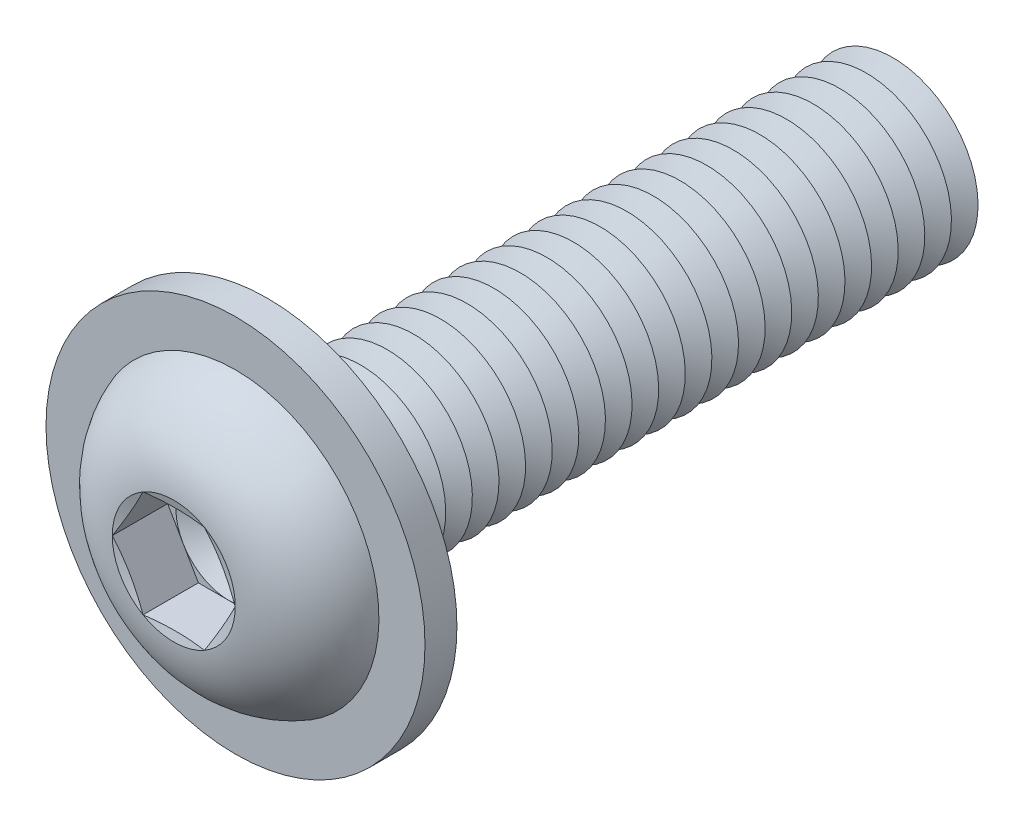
from build123d import *

# Parameters (mm, degrees)
FILLET1_R           = 0.625
LPATTERN1_COUNT     = 24
LPATTERN1_PITCH     = 1.25
CUT_EXTRUDE1_DEPTH  = 2.6
SKETCH5_R           = 8.9
SKETCH5_R_2         = 4.625
BOSS_EXTRUDE1_DEPTH = 1.5


with BuildPart() as part:
    # Sketch1 → Revolve1 (revolve)
    with BuildSketch(Plane(origin=(0, 0, 0), x_dir=(0, 0, -1), z_dir=(1, 0, 0))):
        with BuildLine():
            Line((0, 4), (0, 7))
            ThreePointArc((0, 7), (-3.011595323, 5.81154966), (-4.4, 2.88675))
            Line((-4.4, 2.88675), (-4.013248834, 1.443375))
            Line((-4.013248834, 1.443375), (-4.4, 1.443375))
            Line((-4.4, 1.443375), (-4.4, 0))
            Line((-4.4, 0), (30, 0))
            Line((30, 0), (30, 4))
            Line((30, 4), (0, 4))
        make_face()
    revolve(axis=Axis((0, 0, -30), (0, 0, 1)))

    # Fillet1
    fillet1_edges = [part.edges().sort_by_distance(p)[0] for p in [
        (0, -4, 0),
    ]]
    fillet(fillet1_edges, radius=FILLET1_R)

    # Sketch2 → Cut-Revolve1 (revolve, cut)
    with BuildSketch(Plane(origin=(0, 0, 0), x_dir=(0, 0, -1), z_dir=(1, 0, 0))):
        Polygon((29.375, 4), (30.625, 4), (30, 2.917468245), align=None)
    cut_revolve1 = revolve(axis=Axis((0, 0, -30), (0, 0, -1)), mode=Mode.SUBTRACT)

    # LPattern1: Cut-Revolve1 ×24
    with Locations(*[(0, 0, i * LPATTERN1_PITCH) for i in range(1, LPATTERN1_COUNT)]):
        add(cut_revolve1, mode=Mode.SUBTRACT)

    # Sketch3 → Cut-Extrude1 (cut)
    with BuildSketch(Plane.XY.offset(4.4)):
        Polygon((1.443375, 2.499998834), (-1.443375, 2.499998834), (-2.88675, 0), (-1.443375, -2.499998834), (1.443375, -2.499998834), (2.88675, 0), align=None)
    extrude(amount=-CUT_EXTRUDE1_DEPTH, mode=Mode.SUBTRACT)

    # Cut-Extrude2 cone 1 section (on through the dimple's axis) → Cut-Extrude2 (revolve, cut)
    with BuildSketch(Plane(origin=(0, 0, 1.8), x_dir=(0, -1, 0), z_dir=(1, 0, 0))):
        Polygon((0, 0), (2.499998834, 0), (0, 1.443375), align=None)
    revolve(axis=Axis((0, 0, 1.8), (0, 0, -1)), mode=Mode.SUBTRACT)

    # Sketch5 → Boss-Extrude1 (add)
    with BuildSketch(Plane(origin=(0, 0, 0), x_dir=(-1, 0, 0), z_dir=(0, 0, -1))):
        with Locations(Location((0, 0, 0), (0, 0, 90))):
            Circle(SKETCH5_R)
        Circle(SKETCH5_R_2, mode=Mode.SUBTRACT)
    extrude(amount=-BOSS_EXTRUDE1_DEPTH)


solid = part.part
